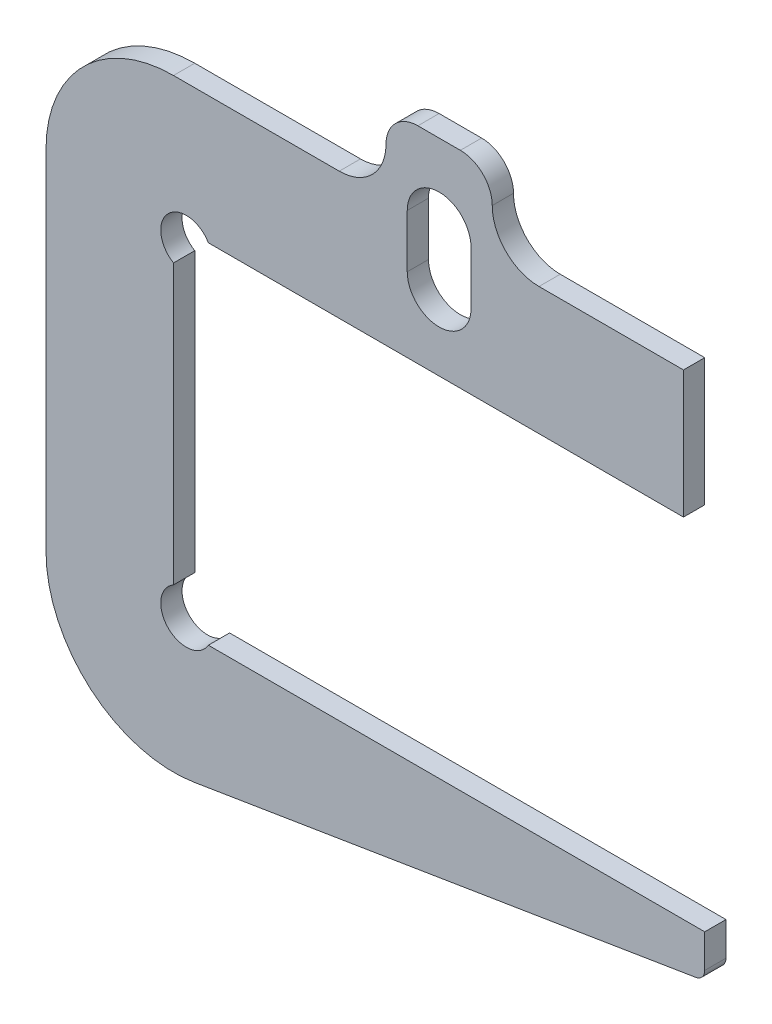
ISO-10303-21;
HEADER;
FILE_DESCRIPTION(('STEP AP214'),'2;1');
FILE_NAME('part.step','',(''),(''),'','','');
FILE_SCHEMA(('AUTOMOTIVE_DESIGN { 1 0 10303 214 1 1 1 1 }'));
ENDSEC;
DATA;
#1=APPLICATION_CONTEXT('core data for automotive mechanical design processes');
#2=APPLICATION_PROTOCOL_DEFINITION('international standard','automotive_design',2000,#1);
#3=PRODUCT_CONTEXT('',#1,'mechanical');
#4=PRODUCT('Part','Part','',(#3));
#5=PRODUCT_RELATED_PRODUCT_CATEGORY('part','',(#4));
#6=PRODUCT_DEFINITION_FORMATION('','',#4);
#7=PRODUCT_DEFINITION_CONTEXT('part definition',#1,'design');
#8=PRODUCT_DEFINITION('design','',#6,#7);
#9=PRODUCT_DEFINITION_SHAPE('','',#8);
#10=(LENGTH_UNIT() NAMED_UNIT(*) SI_UNIT(.MILLI.,.METRE.));
#11=(NAMED_UNIT(*) PLANE_ANGLE_UNIT() SI_UNIT($,.RADIAN.));
#12=(NAMED_UNIT(*) SI_UNIT($,.STERADIAN.) SOLID_ANGLE_UNIT());
#13=UNCERTAINTY_MEASURE_WITH_UNIT(LENGTH_MEASURE(1.E-05),#10,'distance_accuracy_value','');
#14=(GEOMETRIC_REPRESENTATION_CONTEXT(3) GLOBAL_UNCERTAINTY_ASSIGNED_CONTEXT((#13)) GLOBAL_UNIT_ASSIGNED_CONTEXT((#10,
#11,#12)) REPRESENTATION_CONTEXT('',''));
#15=CARTESIAN_POINT('',(0.,0.,0.));
#16=DIRECTION('',(0.,0.,1.));
#17=DIRECTION('',(1.,0.,0.));
#18=AXIS2_PLACEMENT_3D('',#15,#16,#17);
#19=CARTESIAN_POINT('',(-595.,-330.,25.));
#20=DIRECTION('',(0.,0.,1.));
#21=DIRECTION('',(1.,0.,0.));
#22=AXIS2_PLACEMENT_3D('',#19,#20,#21);
#23=PLANE('',#22);
#24=DIRECTION('',(0.,1.,0.));
#25=VECTOR('',#24,1.);
#26=CARTESIAN_POINT('',(575.,0.,25.));
#27=LINE('',#26,#25);
#28=CARTESIAN_POINT('',(575.,-300.,25.));
#29=VERTEX_POINT('',#28);
#30=CARTESIAN_POINT('',(575.,0.,25.));
#31=VERTEX_POINT('',#30);
#32=EDGE_CURVE('E225',#29,#31,#27,.T.);
#33=ORIENTED_EDGE('',*,*,#32,.T.);
#34=DIRECTION('',(-1.,0.,0.));
#35=VECTOR('',#34,1.);
#36=CARTESIAN_POINT('',(235.,0.,25.));
#37=LINE('',#36,#35);
#38=CARTESIAN_POINT('',(235.,0.,25.));
#39=VERTEX_POINT('',#38);
#40=EDGE_CURVE('E228',#31,#39,#37,.T.);
#41=ORIENTED_EDGE('',*,*,#40,.T.);
#42=CARTESIAN_POINT('',(235.,110.,25.));
#43=DIRECTION('',(0.,0.,-1.));
#44=DIRECTION('',(1.,0.,0.));
#45=AXIS2_PLACEMENT_3D('',#42,#43,#44);
#46=CIRCLE('',#45,110.);
#47=CARTESIAN_POINT('',(125.,110.,25.));
#48=VERTEX_POINT('',#47);
#49=EDGE_CURVE('E231',#39,#48,#46,.T.);
#50=ORIENTED_EDGE('',*,*,#49,.T.);
#51=CARTESIAN_POINT('',(50.0000000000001,110.,25.));
#52=DIRECTION('',(0.,0.,1.));
#53=DIRECTION('',(-1.,0.,0.));
#54=AXIS2_PLACEMENT_3D('',#51,#52,#53);
#55=CIRCLE('',#54,75.);
#56=CARTESIAN_POINT('',(50.,185.,25.));
#57=VERTEX_POINT('',#56);
#58=EDGE_CURVE('E233',#48,#57,#55,.T.);
#59=ORIENTED_EDGE('',*,*,#58,.T.);
#60=DIRECTION('',(-1.,0.,0.));
#61=VECTOR('',#60,1.);
#62=CARTESIAN_POINT('',(-50.,185.,25.));
#63=LINE('',#62,#61);
#64=CARTESIAN_POINT('',(-50.,185.,25.));
#65=VERTEX_POINT('',#64);
#66=EDGE_CURVE('E235',#57,#65,#63,.T.);
#67=ORIENTED_EDGE('',*,*,#66,.T.);
#68=CARTESIAN_POINT('',(-50.,110.,25.));
#69=DIRECTION('',(0.,0.,1.));
#70=DIRECTION('',(-1.,0.,0.));
#71=AXIS2_PLACEMENT_3D('',#68,#69,#70);
#72=CIRCLE('',#71,75.);
#73=CARTESIAN_POINT('',(-125.,110.,25.));
#74=VERTEX_POINT('',#73);
#75=EDGE_CURVE('E237',#65,#74,#72,.T.);
#76=ORIENTED_EDGE('',*,*,#75,.T.);
#77=CARTESIAN_POINT('',(-235.,110.,25.));
#78=DIRECTION('',(0.,0.,-1.));
#79=DIRECTION('',(1.,0.,0.));
#80=AXIS2_PLACEMENT_3D('',#77,#78,#79);
#81=CIRCLE('',#80,110.);
#82=CARTESIAN_POINT('',(-235.,0.,25.));
#83=VERTEX_POINT('',#82);
#84=EDGE_CURVE('E239',#74,#83,#81,.T.);
#85=ORIENTED_EDGE('',*,*,#84,.T.);
#86=DIRECTION('',(-1.,0.,0.));
#87=VECTOR('',#86,1.);
#88=CARTESIAN_POINT('',(-625.,0.,25.));
#89=LINE('',#88,#87);
#90=CARTESIAN_POINT('',(-625.,0.,25.));
#91=VERTEX_POINT('',#90);
#92=EDGE_CURVE('E241',#83,#91,#89,.T.);
#93=ORIENTED_EDGE('',*,*,#92,.T.);
#94=CARTESIAN_POINT('',(-625.,-300.,25.));
#95=DIRECTION('',(0.,0.,1.));
#96=DIRECTION('',(-1.,0.,0.));
#97=AXIS2_PLACEMENT_3D('',#94,#95,#96);
#98=CIRCLE('',#97,300.);
#99=CARTESIAN_POINT('',(-925.,-300.,25.));
#100=VERTEX_POINT('',#99);
#101=EDGE_CURVE('E243',#91,#100,#98,.T.);
#102=ORIENTED_EDGE('',*,*,#101,.T.);
#103=DIRECTION('',(0.,-1.,0.));
#104=VECTOR('',#103,1.);
#105=CARTESIAN_POINT('',(-925.,-1120.,25.));
#106=LINE('',#105,#104);
#107=CARTESIAN_POINT('',(-925.,-1120.,25.));
#108=VERTEX_POINT('',#107);
#109=EDGE_CURVE('E245',#100,#108,#106,.T.);
#110=ORIENTED_EDGE('',*,*,#109,.T.);
#111=CARTESIAN_POINT('',(-625.,-1120.,25.));
#112=DIRECTION('',(0.,0.,1.));
#113=DIRECTION('',(-1.,0.,0.));
#114=AXIS2_PLACEMENT_3D('',#111,#112,#113);
#115=CIRCLE('',#114,300.);
#116=CARTESIAN_POINT('',(-576.686732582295,-1416.08415727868,25.));
#117=VERTEX_POINT('',#116);
#118=EDGE_CURVE('E247',#108,#117,#115,.T.);
#119=ORIENTED_EDGE('',*,*,#118,.T.);
#120=DIRECTION('',(0.986947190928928,0.161044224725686,0.));
#121=VECTOR('',#120,1.);
#122=CARTESIAN_POINT('',(604.026105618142,-1223.4223964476,25.));
#123=LINE('',#122,#121);
#124=CARTESIAN_POINT('',(604.026105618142,-1223.4223964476,25.));
#125=VERTEX_POINT('',#124);
#126=EDGE_CURVE('E249',#117,#125,#123,.T.);
#127=ORIENTED_EDGE('',*,*,#126,.T.);
#128=CARTESIAN_POINT('',(600.,-1198.74871667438,25.));
#129=DIRECTION('',(0.,0.,1.));
#130=DIRECTION('',(-1.,0.,0.));
#131=AXIS2_PLACEMENT_3D('',#128,#129,#130);
#132=CIRCLE('',#131,25.0000000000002);
#133=CARTESIAN_POINT('',(625.,-1198.74871667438,25.));
#134=VERTEX_POINT('',#133);
#135=EDGE_CURVE('E251',#125,#134,#132,.T.);
#136=ORIENTED_EDGE('',*,*,#135,.T.);
#137=DIRECTION('',(0.,1.,0.));
#138=VECTOR('',#137,1.);
#139=CARTESIAN_POINT('',(625.,-1120.,25.));
#140=LINE('',#139,#138);
#141=CARTESIAN_POINT('',(625.,-1120.,25.));
#142=VERTEX_POINT('',#141);
#143=EDGE_CURVE('E253',#134,#142,#140,.T.);
#144=ORIENTED_EDGE('',*,*,#143,.T.);
#145=DIRECTION('',(-1.,0.,0.));
#146=VECTOR('',#145,1.);
#147=CARTESIAN_POINT('',(-543.038475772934,-1120.,25.));
#148=LINE('',#147,#146);
#149=CARTESIAN_POINT('',(-543.038475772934,-1120.,25.));
#150=VERTEX_POINT('',#149);
#151=EDGE_CURVE('E255',#142,#150,#148,.T.);
#152=ORIENTED_EDGE('',*,*,#151,.T.);
#153=CARTESIAN_POINT('',(-595.,-1090.,25.));
#154=DIRECTION('',(0.,0.,-1.));
#155=DIRECTION('',(1.,0.,0.));
#156=AXIS2_PLACEMENT_3D('',#153,#154,#155);
#157=CIRCLE('',#156,60.);
#158=CARTESIAN_POINT('',(-625.,-1038.03847577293,25.));
#159=VERTEX_POINT('',#158);
#160=EDGE_CURVE('E257',#150,#159,#157,.T.);
#161=ORIENTED_EDGE('',*,*,#160,.T.);
#162=DIRECTION('',(0.,1.,0.));
#163=VECTOR('',#162,1.);
#164=CARTESIAN_POINT('',(-625.,-381.961524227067,25.));
#165=LINE('',#164,#163);
#166=CARTESIAN_POINT('',(-625.,-381.961524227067,25.));
#167=VERTEX_POINT('',#166);
#168=EDGE_CURVE('E259',#159,#167,#165,.T.);
#169=ORIENTED_EDGE('',*,*,#168,.T.);
#170=CARTESIAN_POINT('',(-595.,-330.,25.));
#171=DIRECTION('',(0.,0.,-1.));
#172=DIRECTION('',(1.,0.,0.));
#173=AXIS2_PLACEMENT_3D('',#170,#171,#172);
#174=CIRCLE('',#173,60.);
#175=CARTESIAN_POINT('',(-543.038475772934,-300.,25.));
#176=VERTEX_POINT('',#175);
#177=EDGE_CURVE('E261',#167,#176,#174,.T.);
#178=ORIENTED_EDGE('',*,*,#177,.T.);
#179=DIRECTION('',(1.,0.,0.));
#180=VECTOR('',#179,1.);
#181=CARTESIAN_POINT('',(575.,-300.,25.));
#182=LINE('',#181,#180);
#183=EDGE_CURVE('E263',#176,#29,#182,.T.);
#184=ORIENTED_EDGE('',*,*,#183,.T.);
#185=EDGE_LOOP('',(#33,#41,#50,#59,#67,#76,#85,#93,#102,#110,#119,#127,#136,#144,#152,#161,#169,
#178,#184));
#186=FACE_BOUND('',#185,.T.);
#187=DIRECTION('',(0.,-1.,0.));
#188=VECTOR('',#187,1.);
#189=CARTESIAN_POINT('',(-75.,0.,25.));
#190=LINE('',#189,#188);
#191=CARTESIAN_POINT('',(-75.,0.,25.));
#192=VERTEX_POINT('',#191);
#193=CARTESIAN_POINT('',(-75.,-125.,25.));
#194=VERTEX_POINT('',#193);
#195=EDGE_CURVE('E197',#192,#194,#190,.T.);
#196=ORIENTED_EDGE('',*,*,#195,.F.);
#197=CARTESIAN_POINT('',(0.,0.,25.));
#198=DIRECTION('',(0.,0.,1.));
#199=DIRECTION('',(1.,0.,0.));
#200=AXIS2_PLACEMENT_3D('',#197,#198,#199);
#201=CIRCLE('',#200,75.);
#202=CARTESIAN_POINT('',(75.,0.,25.));
#203=VERTEX_POINT('',#202);
#204=EDGE_CURVE('E189',#203,#192,#201,.T.);
#205=ORIENTED_EDGE('',*,*,#204,.F.);
#206=DIRECTION('',(0.,1.,0.));
#207=VECTOR('',#206,1.);
#208=CARTESIAN_POINT('',(75.,0.,25.));
#209=LINE('',#208,#207);
#210=CARTESIAN_POINT('',(74.9999999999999,-125.,25.));
#211=VERTEX_POINT('',#210);
#212=EDGE_CURVE('E211',#211,#203,#209,.T.);
#213=ORIENTED_EDGE('',*,*,#212,.F.);
#214=CARTESIAN_POINT('',(0.,-125.,25.));
#215=DIRECTION('',(0.,0.,1.));
#216=DIRECTION('',(1.,0.,0.));
#217=AXIS2_PLACEMENT_3D('',#214,#215,#216);
#218=CIRCLE('',#217,75.);
#219=EDGE_CURVE('E209',#194,#211,#218,.T.);
#220=ORIENTED_EDGE('',*,*,#219,.F.);
#221=EDGE_LOOP('',(#196,#205,#213,#220));
#222=FACE_BOUND('',#221,.T.);
#223=ADVANCED_FACE('F34',(#186,#222),#23,.T.);
#224=CARTESIAN_POINT('',(-595.,-330.,-25.));
#225=DIRECTION('',(0.,0.,1.));
#226=DIRECTION('',(1.,0.,0.));
#227=AXIS2_PLACEMENT_3D('',#224,#225,#226);
#228=PLANE('',#227);
#229=DIRECTION('',(0.,1.,0.));
#230=VECTOR('',#229,1.);
#231=CARTESIAN_POINT('',(575.,0.,-25.));
#232=LINE('',#231,#230);
#233=CARTESIAN_POINT('',(575.,-300.,-25.));
#234=VERTEX_POINT('',#233);
#235=CARTESIAN_POINT('',(575.,0.,-25.));
#236=VERTEX_POINT('',#235);
#237=EDGE_CURVE('E205',#234,#236,#232,.T.);
#238=ORIENTED_EDGE('',*,*,#237,.F.);
#239=DIRECTION('',(1.,0.,0.));
#240=VECTOR('',#239,1.);
#241=CARTESIAN_POINT('',(575.,-300.,-25.));
#242=LINE('',#241,#240);
#243=CARTESIAN_POINT('',(-543.038475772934,-300.,-25.));
#244=VERTEX_POINT('',#243);
#245=EDGE_CURVE('E229',#244,#234,#242,.T.);
#246=ORIENTED_EDGE('',*,*,#245,.F.);
#247=CARTESIAN_POINT('',(-595.,-330.,-25.));
#248=DIRECTION('',(0.,0.,-1.));
#249=DIRECTION('',(1.,0.,0.));
#250=AXIS2_PLACEMENT_3D('',#247,#248,#249);
#251=CIRCLE('',#250,60.);
#252=CARTESIAN_POINT('',(-625.,-381.961524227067,-25.));
#253=VERTEX_POINT('',#252);
#254=EDGE_CURVE('E300',#253,#244,#251,.T.);
#255=ORIENTED_EDGE('',*,*,#254,.F.);
#256=DIRECTION('',(0.,1.,0.));
#257=VECTOR('',#256,1.);
#258=CARTESIAN_POINT('',(-625.,-381.961524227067,-25.));
#259=LINE('',#258,#257);
#260=CARTESIAN_POINT('',(-625.,-1038.03847577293,-25.));
#261=VERTEX_POINT('',#260);
#262=EDGE_CURVE('E298',#261,#253,#259,.T.);
#263=ORIENTED_EDGE('',*,*,#262,.F.);
#264=CARTESIAN_POINT('',(-595.,-1090.,-25.));
#265=DIRECTION('',(0.,0.,-1.));
#266=DIRECTION('',(1.,0.,0.));
#267=AXIS2_PLACEMENT_3D('',#264,#265,#266);
#268=CIRCLE('',#267,60.);
#269=CARTESIAN_POINT('',(-543.038475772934,-1120.,-25.));
#270=VERTEX_POINT('',#269);
#271=EDGE_CURVE('E296',#270,#261,#268,.T.);
#272=ORIENTED_EDGE('',*,*,#271,.F.);
#273=DIRECTION('',(-1.,0.,0.));
#274=VECTOR('',#273,1.);
#275=CARTESIAN_POINT('',(-543.038475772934,-1120.,-25.));
#276=LINE('',#275,#274);
#277=CARTESIAN_POINT('',(625.,-1120.,-25.));
#278=VERTEX_POINT('',#277);
#279=EDGE_CURVE('E294',#278,#270,#276,.T.);
#280=ORIENTED_EDGE('',*,*,#279,.F.);
#281=DIRECTION('',(0.,1.,0.));
#282=VECTOR('',#281,1.);
#283=CARTESIAN_POINT('',(625.,-1120.,-25.));
#284=LINE('',#283,#282);
#285=CARTESIAN_POINT('',(625.,-1198.74871667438,-25.));
#286=VERTEX_POINT('',#285);
#287=EDGE_CURVE('E292',#286,#278,#284,.T.);
#288=ORIENTED_EDGE('',*,*,#287,.F.);
#289=CARTESIAN_POINT('',(600.,-1198.74871667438,-25.));
#290=DIRECTION('',(0.,0.,1.));
#291=DIRECTION('',(-1.,0.,0.));
#292=AXIS2_PLACEMENT_3D('',#289,#290,#291);
#293=CIRCLE('',#292,25.0000000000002);
#294=CARTESIAN_POINT('',(604.026105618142,-1223.4223964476,-25.));
#295=VERTEX_POINT('',#294);
#296=EDGE_CURVE('E290',#295,#286,#293,.T.);
#297=ORIENTED_EDGE('',*,*,#296,.F.);
#298=DIRECTION('',(0.986947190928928,0.161044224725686,0.));
#299=VECTOR('',#298,1.);
#300=CARTESIAN_POINT('',(604.026105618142,-1223.4223964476,-25.));
#301=LINE('',#300,#299);
#302=CARTESIAN_POINT('',(-576.686732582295,-1416.08415727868,-25.));
#303=VERTEX_POINT('',#302);
#304=EDGE_CURVE('E288',#303,#295,#301,.T.);
#305=ORIENTED_EDGE('',*,*,#304,.F.);
#306=CARTESIAN_POINT('',(-625.,-1120.,-25.));
#307=DIRECTION('',(0.,0.,1.));
#308=DIRECTION('',(-1.,0.,0.));
#309=AXIS2_PLACEMENT_3D('',#306,#307,#308);
#310=CIRCLE('',#309,300.);
#311=CARTESIAN_POINT('',(-925.,-1120.,-25.));
#312=VERTEX_POINT('',#311);
#313=EDGE_CURVE('E286',#312,#303,#310,.T.);
#314=ORIENTED_EDGE('',*,*,#313,.F.);
#315=DIRECTION('',(0.,-1.,0.));
#316=VECTOR('',#315,1.);
#317=CARTESIAN_POINT('',(-925.,-1120.,-25.));
#318=LINE('',#317,#316);
#319=CARTESIAN_POINT('',(-925.,-300.,-25.));
#320=VERTEX_POINT('',#319);
#321=EDGE_CURVE('E284',#320,#312,#318,.T.);
#322=ORIENTED_EDGE('',*,*,#321,.F.);
#323=CARTESIAN_POINT('',(-625.,-300.,-25.));
#324=DIRECTION('',(0.,0.,1.));
#325=DIRECTION('',(-1.,0.,0.));
#326=AXIS2_PLACEMENT_3D('',#323,#324,#325);
#327=CIRCLE('',#326,300.);
#328=CARTESIAN_POINT('',(-625.,0.,-25.));
#329=VERTEX_POINT('',#328);
#330=EDGE_CURVE('E282',#329,#320,#327,.T.);
#331=ORIENTED_EDGE('',*,*,#330,.F.);
#332=DIRECTION('',(-1.,0.,0.));
#333=VECTOR('',#332,1.);
#334=CARTESIAN_POINT('',(-625.,0.,-25.));
#335=LINE('',#334,#333);
#336=CARTESIAN_POINT('',(-235.,0.,-25.));
#337=VERTEX_POINT('',#336);
#338=EDGE_CURVE('E280',#337,#329,#335,.T.);
#339=ORIENTED_EDGE('',*,*,#338,.F.);
#340=CARTESIAN_POINT('',(-235.,110.,-25.));
#341=DIRECTION('',(0.,0.,-1.));
#342=DIRECTION('',(1.,0.,0.));
#343=AXIS2_PLACEMENT_3D('',#340,#341,#342);
#344=CIRCLE('',#343,110.);
#345=CARTESIAN_POINT('',(-125.,110.,-25.));
#346=VERTEX_POINT('',#345);
#347=EDGE_CURVE('E278',#346,#337,#344,.T.);
#348=ORIENTED_EDGE('',*,*,#347,.F.);
#349=CARTESIAN_POINT('',(-50.,110.,-25.));
#350=DIRECTION('',(0.,0.,1.));
#351=DIRECTION('',(-1.,0.,0.));
#352=AXIS2_PLACEMENT_3D('',#349,#350,#351);
#353=CIRCLE('',#352,75.);
#354=CARTESIAN_POINT('',(-50.,185.,-25.));
#355=VERTEX_POINT('',#354);
#356=EDGE_CURVE('E276',#355,#346,#353,.T.);
#357=ORIENTED_EDGE('',*,*,#356,.F.);
#358=DIRECTION('',(-1.,0.,0.));
#359=VECTOR('',#358,1.);
#360=CARTESIAN_POINT('',(-50.,185.,-25.));
#361=LINE('',#360,#359);
#362=CARTESIAN_POINT('',(50.,185.,-25.));
#363=VERTEX_POINT('',#362);
#364=EDGE_CURVE('E274',#363,#355,#361,.T.);
#365=ORIENTED_EDGE('',*,*,#364,.F.);
#366=CARTESIAN_POINT('',(50.0000000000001,110.,-25.));
#367=DIRECTION('',(0.,0.,1.));
#368=DIRECTION('',(-1.,0.,0.));
#369=AXIS2_PLACEMENT_3D('',#366,#367,#368);
#370=CIRCLE('',#369,75.);
#371=CARTESIAN_POINT('',(125.,110.,-25.));
#372=VERTEX_POINT('',#371);
#373=EDGE_CURVE('E272',#372,#363,#370,.T.);
#374=ORIENTED_EDGE('',*,*,#373,.F.);
#375=CARTESIAN_POINT('',(235.,110.,-25.));
#376=DIRECTION('',(0.,0.,-1.));
#377=DIRECTION('',(1.,0.,0.));
#378=AXIS2_PLACEMENT_3D('',#375,#376,#377);
#379=CIRCLE('',#378,110.);
#380=CARTESIAN_POINT('',(235.,0.,-25.));
#381=VERTEX_POINT('',#380);
#382=EDGE_CURVE('E270',#381,#372,#379,.T.);
#383=ORIENTED_EDGE('',*,*,#382,.F.);
#384=DIRECTION('',(-1.,0.,0.));
#385=VECTOR('',#384,1.);
#386=CARTESIAN_POINT('',(235.,0.,-25.));
#387=LINE('',#386,#385);
#388=EDGE_CURVE('E268',#236,#381,#387,.T.);
#389=ORIENTED_EDGE('',*,*,#388,.F.);
#390=EDGE_LOOP('',(#238,#246,#255,#263,#272,#280,#288,#297,#305,#314,#322,#331,#339,#348,#357,
#365,#374,#383,#389));
#391=FACE_BOUND('',#390,.T.);
#392=CARTESIAN_POINT('',(0.,0.,-25.));
#393=DIRECTION('',(0.,0.,1.));
#394=DIRECTION('',(1.,0.,0.));
#395=AXIS2_PLACEMENT_3D('',#392,#393,#394);
#396=CIRCLE('',#395,75.);
#397=CARTESIAN_POINT('',(74.9999999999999,0.,-25.));
#398=VERTEX_POINT('',#397);
#399=CARTESIAN_POINT('',(-75.,0.,-25.));
#400=VERTEX_POINT('',#399);
#401=EDGE_CURVE('E57',#398,#400,#396,.T.);
#402=ORIENTED_EDGE('',*,*,#401,.T.);
#403=DIRECTION('',(0.,-1.,0.));
#404=VECTOR('',#403,1.);
#405=CARTESIAN_POINT('',(-75.,0.,-25.));
#406=LINE('',#405,#404);
#407=CARTESIAN_POINT('',(-75.,-125.,-25.));
#408=VERTEX_POINT('',#407);
#409=EDGE_CURVE('E204',#400,#408,#406,.T.);
#410=ORIENTED_EDGE('',*,*,#409,.T.);
#411=CARTESIAN_POINT('',(0.,-125.,-25.));
#412=DIRECTION('',(0.,0.,1.));
#413=DIRECTION('',(1.,0.,0.));
#414=AXIS2_PLACEMENT_3D('',#411,#412,#413);
#415=CIRCLE('',#414,75.);
#416=CARTESIAN_POINT('',(75.,-125.,-25.));
#417=VERTEX_POINT('',#416);
#418=EDGE_CURVE('E217',#408,#417,#415,.T.);
#419=ORIENTED_EDGE('',*,*,#418,.T.);
#420=DIRECTION('',(0.,1.,0.));
#421=VECTOR('',#420,1.);
#422=CARTESIAN_POINT('',(75.,0.,-25.));
#423=LINE('',#422,#421);
#424=EDGE_CURVE('E198',#417,#398,#423,.T.);
#425=ORIENTED_EDGE('',*,*,#424,.T.);
#426=EDGE_LOOP('',(#402,#410,#419,#425));
#427=FACE_BOUND('',#426,.T.);
#428=ADVANCED_FACE('F363',(#391,#427),#228,.F.);
#429=CARTESIAN_POINT('',(575.,0.,25.));
#430=DIRECTION('',(-1.,0.,0.));
#431=DIRECTION('',(0.,-1.,0.));
#432=AXIS2_PLACEMENT_3D('',#429,#430,#431);
#433=PLANE('',#432);
#434=ORIENTED_EDGE('',*,*,#237,.T.);
#435=DIRECTION('',(0.,0.,-1.));
#436=VECTOR('',#435,1.);
#437=CARTESIAN_POINT('',(575.,0.,25.));
#438=LINE('',#437,#436);
#439=EDGE_CURVE('E11',#31,#236,#438,.T.);
#440=ORIENTED_EDGE('',*,*,#439,.F.);
#441=ORIENTED_EDGE('',*,*,#32,.F.);
#442=DIRECTION('',(0.,0.,-1.));
#443=VECTOR('',#442,1.);
#444=CARTESIAN_POINT('',(575.,-300.,25.));
#445=LINE('',#444,#443);
#446=EDGE_CURVE('E265',#29,#234,#445,.T.);
#447=ORIENTED_EDGE('',*,*,#446,.T.);
#448=EDGE_LOOP('',(#434,#440,#441,#447));
#449=FACE_BOUND('',#448,.T.);
#450=ADVANCED_FACE('F36',(#449),#433,.F.);
#451=CARTESIAN_POINT('',(235.,0.,25.));
#452=DIRECTION('',(0.,-1.,0.));
#453=DIRECTION('',(0.,0.,-1.));
#454=AXIS2_PLACEMENT_3D('',#451,#452,#453);
#455=PLANE('',#454);
#456=ORIENTED_EDGE('',*,*,#388,.T.);
#457=DIRECTION('',(0.,0.,-1.));
#458=VECTOR('',#457,1.);
#459=CARTESIAN_POINT('',(235.,0.,25.));
#460=LINE('',#459,#458);
#461=EDGE_CURVE('E42',#39,#381,#460,.T.);
#462=ORIENTED_EDGE('',*,*,#461,.F.);
#463=ORIENTED_EDGE('',*,*,#40,.F.);
#464=ORIENTED_EDGE('',*,*,#439,.T.);
#465=EDGE_LOOP('',(#456,#462,#463,#464));
#466=FACE_BOUND('',#465,.T.);
#467=ADVANCED_FACE('F380',(#466),#455,.F.);
#468=CARTESIAN_POINT('',(235.,110.,25.));
#469=DIRECTION('',(0.,0.,-1.));
#470=DIRECTION('',(-1.,0.,0.));
#471=AXIS2_PLACEMENT_3D('',#468,#469,#470);
#472=CYLINDRICAL_SURFACE('',#471,110.);
#473=ORIENTED_EDGE('',*,*,#382,.T.);
#474=DIRECTION('',(0.,0.,-1.));
#475=VECTOR('',#474,1.);
#476=CARTESIAN_POINT('',(125.,110.,25.));
#477=LINE('',#476,#475);
#478=EDGE_CURVE('E350',#48,#372,#477,.T.);
#479=ORIENTED_EDGE('',*,*,#478,.F.);
#480=ORIENTED_EDGE('',*,*,#49,.F.);
#481=ORIENTED_EDGE('',*,*,#461,.T.);
#482=EDGE_LOOP('',(#473,#479,#480,#481));
#483=FACE_BOUND('',#482,.T.);
#484=ADVANCED_FACE('F357',(#483),#472,.F.);
#485=CARTESIAN_POINT('',(50.0000000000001,110.,25.));
#486=DIRECTION('',(0.,0.,-1.));
#487=DIRECTION('',(-1.,0.,0.));
#488=AXIS2_PLACEMENT_3D('',#485,#486,#487);
#489=CYLINDRICAL_SURFACE('',#488,75.);
#490=ORIENTED_EDGE('',*,*,#373,.T.);
#491=DIRECTION('',(0.,0.,-1.));
#492=VECTOR('',#491,1.);
#493=CARTESIAN_POINT('',(50.,185.,25.));
#494=LINE('',#493,#492);
#495=EDGE_CURVE('E347',#57,#363,#494,.T.);
#496=ORIENTED_EDGE('',*,*,#495,.F.);
#497=ORIENTED_EDGE('',*,*,#58,.F.);
#498=ORIENTED_EDGE('',*,*,#478,.T.);
#499=EDGE_LOOP('',(#490,#496,#497,#498));
#500=FACE_BOUND('',#499,.T.);
#501=ADVANCED_FACE('F369',(#500),#489,.T.);
#502=CARTESIAN_POINT('',(-50.,185.,25.));
#503=DIRECTION('',(0.,-1.,0.));
#504=DIRECTION('',(0.,0.,-1.));
#505=AXIS2_PLACEMENT_3D('',#502,#503,#504);
#506=PLANE('',#505);
#507=ORIENTED_EDGE('',*,*,#364,.T.);
#508=DIRECTION('',(0.,0.,-1.));
#509=VECTOR('',#508,1.);
#510=CARTESIAN_POINT('',(-50.,185.,25.));
#511=LINE('',#510,#509);
#512=EDGE_CURVE('E344',#65,#355,#511,.T.);
#513=ORIENTED_EDGE('',*,*,#512,.F.);
#514=ORIENTED_EDGE('',*,*,#66,.F.);
#515=ORIENTED_EDGE('',*,*,#495,.T.);
#516=EDGE_LOOP('',(#507,#513,#514,#515));
#517=FACE_BOUND('',#516,.T.);
#518=ADVANCED_FACE('F373',(#517),#506,.F.);
#519=CARTESIAN_POINT('',(-50.,110.,25.));
#520=DIRECTION('',(0.,0.,-1.));
#521=DIRECTION('',(-1.,0.,0.));
#522=AXIS2_PLACEMENT_3D('',#519,#520,#521);
#523=CYLINDRICAL_SURFACE('',#522,75.);
#524=ORIENTED_EDGE('',*,*,#356,.T.);
#525=DIRECTION('',(0.,0.,-1.));
#526=VECTOR('',#525,1.);
#527=CARTESIAN_POINT('',(-125.,110.,25.));
#528=LINE('',#527,#526);
#529=EDGE_CURVE('E341',#74,#346,#528,.T.);
#530=ORIENTED_EDGE('',*,*,#529,.F.);
#531=ORIENTED_EDGE('',*,*,#75,.F.);
#532=ORIENTED_EDGE('',*,*,#512,.T.);
#533=EDGE_LOOP('',(#524,#530,#531,#532));
#534=FACE_BOUND('',#533,.T.);
#535=ADVANCED_FACE('F448',(#534),#523,.T.);
#536=CARTESIAN_POINT('',(-235.,110.,25.));
#537=DIRECTION('',(0.,0.,-1.));
#538=DIRECTION('',(-1.,0.,0.));
#539=AXIS2_PLACEMENT_3D('',#536,#537,#538);
#540=CYLINDRICAL_SURFACE('',#539,110.);
#541=ORIENTED_EDGE('',*,*,#347,.T.);
#542=DIRECTION('',(0.,0.,-1.));
#543=VECTOR('',#542,1.);
#544=CARTESIAN_POINT('',(-235.,0.,25.));
#545=LINE('',#544,#543);
#546=EDGE_CURVE('E338',#83,#337,#545,.T.);
#547=ORIENTED_EDGE('',*,*,#546,.F.);
#548=ORIENTED_EDGE('',*,*,#84,.F.);
#549=ORIENTED_EDGE('',*,*,#529,.T.);
#550=EDGE_LOOP('',(#541,#547,#548,#549));
#551=FACE_BOUND('',#550,.T.);
#552=ADVANCED_FACE('F445',(#551),#540,.F.);
#553=CARTESIAN_POINT('',(-625.,0.,25.));
#554=DIRECTION('',(0.,-1.,0.));
#555=DIRECTION('',(0.,0.,-1.));
#556=AXIS2_PLACEMENT_3D('',#553,#554,#555);
#557=PLANE('',#556);
#558=ORIENTED_EDGE('',*,*,#338,.T.);
#559=DIRECTION('',(0.,0.,-1.));
#560=VECTOR('',#559,1.);
#561=CARTESIAN_POINT('',(-625.,0.,25.));
#562=LINE('',#561,#560);
#563=EDGE_CURVE('E335',#91,#329,#562,.T.);
#564=ORIENTED_EDGE('',*,*,#563,.F.);
#565=ORIENTED_EDGE('',*,*,#92,.F.);
#566=ORIENTED_EDGE('',*,*,#546,.T.);
#567=EDGE_LOOP('',(#558,#564,#565,#566));
#568=FACE_BOUND('',#567,.T.);
#569=ADVANCED_FACE('F441',(#568),#557,.F.);
#570=CARTESIAN_POINT('',(-625.,-300.,25.));
#571=DIRECTION('',(0.,0.,-1.));
#572=DIRECTION('',(-1.,0.,0.));
#573=AXIS2_PLACEMENT_3D('',#570,#571,#572);
#574=CYLINDRICAL_SURFACE('',#573,300.);
#575=ORIENTED_EDGE('',*,*,#330,.T.);
#576=DIRECTION('',(0.,0.,-1.));
#577=VECTOR('',#576,1.);
#578=CARTESIAN_POINT('',(-925.,-300.,25.));
#579=LINE('',#578,#577);
#580=EDGE_CURVE('E332',#100,#320,#579,.T.);
#581=ORIENTED_EDGE('',*,*,#580,.F.);
#582=ORIENTED_EDGE('',*,*,#101,.F.);
#583=ORIENTED_EDGE('',*,*,#563,.T.);
#584=EDGE_LOOP('',(#575,#581,#582,#583));
#585=FACE_BOUND('',#584,.T.);
#586=ADVANCED_FACE('F437',(#585),#574,.T.);
#587=CARTESIAN_POINT('',(-925.,-1120.,25.));
#588=DIRECTION('',(1.,0.,0.));
#589=DIRECTION('',(0.,0.,-1.));
#590=AXIS2_PLACEMENT_3D('',#587,#588,#589);
#591=PLANE('',#590);
#592=ORIENTED_EDGE('',*,*,#321,.T.);
#593=DIRECTION('',(0.,0.,-1.));
#594=VECTOR('',#593,1.);
#595=CARTESIAN_POINT('',(-925.,-1120.,25.));
#596=LINE('',#595,#594);
#597=EDGE_CURVE('E329',#108,#312,#596,.T.);
#598=ORIENTED_EDGE('',*,*,#597,.F.);
#599=ORIENTED_EDGE('',*,*,#109,.F.);
#600=ORIENTED_EDGE('',*,*,#580,.T.);
#601=EDGE_LOOP('',(#592,#598,#599,#600));
#602=FACE_BOUND('',#601,.T.);
#603=ADVANCED_FACE('F432',(#602),#591,.F.);
#604=CARTESIAN_POINT('',(-625.,-1120.,25.));
#605=DIRECTION('',(0.,0.,-1.));
#606=DIRECTION('',(-1.,0.,0.));
#607=AXIS2_PLACEMENT_3D('',#604,#605,#606);
#608=CYLINDRICAL_SURFACE('',#607,300.);
#609=ORIENTED_EDGE('',*,*,#313,.T.);
#610=DIRECTION('',(0.,0.,-1.));
#611=VECTOR('',#610,1.);
#612=CARTESIAN_POINT('',(-576.686732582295,-1416.08415727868,25.));
#613=LINE('',#612,#611);
#614=EDGE_CURVE('E326',#117,#303,#613,.T.);
#615=ORIENTED_EDGE('',*,*,#614,.F.);
#616=ORIENTED_EDGE('',*,*,#118,.F.);
#617=ORIENTED_EDGE('',*,*,#597,.T.);
#618=EDGE_LOOP('',(#609,#615,#616,#617));
#619=FACE_BOUND('',#618,.T.);
#620=ADVANCED_FACE('F426',(#619),#608,.T.);
#621=CARTESIAN_POINT('',(604.026105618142,-1223.4223964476,25.));
#622=DIRECTION('',(-0.161044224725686,0.986947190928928,0.));
#623=DIRECTION('',(-0.986947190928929,-0.161044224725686,0.));
#624=AXIS2_PLACEMENT_3D('',#621,#622,#623);
#625=PLANE('',#624);
#626=ORIENTED_EDGE('',*,*,#304,.T.);
#627=DIRECTION('',(0.,0.,-1.));
#628=VECTOR('',#627,1.);
#629=CARTESIAN_POINT('',(604.026105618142,-1223.4223964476,25.));
#630=LINE('',#629,#628);
#631=EDGE_CURVE('E323',#125,#295,#630,.T.);
#632=ORIENTED_EDGE('',*,*,#631,.F.);
#633=ORIENTED_EDGE('',*,*,#126,.F.);
#634=ORIENTED_EDGE('',*,*,#614,.T.);
#635=EDGE_LOOP('',(#626,#632,#633,#634));
#636=FACE_BOUND('',#635,.T.);
#637=ADVANCED_FACE('F422',(#636),#625,.F.);
#638=CARTESIAN_POINT('',(600.,-1198.74871667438,25.));
#639=DIRECTION('',(0.,0.,-1.));
#640=DIRECTION('',(-1.,0.,0.));
#641=AXIS2_PLACEMENT_3D('',#638,#639,#640);
#642=CYLINDRICAL_SURFACE('',#641,25.0000000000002);
#643=ORIENTED_EDGE('',*,*,#296,.T.);
#644=DIRECTION('',(0.,0.,-1.));
#645=VECTOR('',#644,1.);
#646=CARTESIAN_POINT('',(625.,-1198.74871667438,25.));
#647=LINE('',#646,#645);
#648=EDGE_CURVE('E320',#134,#286,#647,.T.);
#649=ORIENTED_EDGE('',*,*,#648,.F.);
#650=ORIENTED_EDGE('',*,*,#135,.F.);
#651=ORIENTED_EDGE('',*,*,#631,.T.);
#652=EDGE_LOOP('',(#643,#649,#650,#651));
#653=FACE_BOUND('',#652,.T.);
#654=ADVANCED_FACE('F417',(#653),#642,.T.);
#655=CARTESIAN_POINT('',(625.,-1120.,25.));
#656=DIRECTION('',(-1.,0.,0.));
#657=DIRECTION('',(0.,-1.,0.));
#658=AXIS2_PLACEMENT_3D('',#655,#656,#657);
#659=PLANE('',#658);
#660=ORIENTED_EDGE('',*,*,#287,.T.);
#661=DIRECTION('',(0.,0.,-1.));
#662=VECTOR('',#661,1.);
#663=CARTESIAN_POINT('',(625.,-1120.,25.));
#664=LINE('',#663,#662);
#665=EDGE_CURVE('E317',#142,#278,#664,.T.);
#666=ORIENTED_EDGE('',*,*,#665,.F.);
#667=ORIENTED_EDGE('',*,*,#143,.F.);
#668=ORIENTED_EDGE('',*,*,#648,.T.);
#669=EDGE_LOOP('',(#660,#666,#667,#668));
#670=FACE_BOUND('',#669,.T.);
#671=ADVANCED_FACE('F411',(#670),#659,.F.);
#672=CARTESIAN_POINT('',(-543.038475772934,-1120.,25.));
#673=DIRECTION('',(0.,-1.,0.));
#674=DIRECTION('',(1.,0.,0.));
#675=AXIS2_PLACEMENT_3D('',#672,#673,#674);
#676=PLANE('',#675);
#677=ORIENTED_EDGE('',*,*,#279,.T.);
#678=DIRECTION('',(0.,0.,-1.));
#679=VECTOR('',#678,1.);
#680=CARTESIAN_POINT('',(-543.038475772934,-1120.,25.));
#681=LINE('',#680,#679);
#682=EDGE_CURVE('E314',#150,#270,#681,.T.);
#683=ORIENTED_EDGE('',*,*,#682,.F.);
#684=ORIENTED_EDGE('',*,*,#151,.F.);
#685=ORIENTED_EDGE('',*,*,#665,.T.);
#686=EDGE_LOOP('',(#677,#683,#684,#685));
#687=FACE_BOUND('',#686,.T.);
#688=ADVANCED_FACE('F407',(#687),#676,.F.);
#689=CARTESIAN_POINT('',(-595.,-1090.,25.));
#690=DIRECTION('',(0.,0.,-1.));
#691=DIRECTION('',(-1.,0.,0.));
#692=AXIS2_PLACEMENT_3D('',#689,#690,#691);
#693=CYLINDRICAL_SURFACE('',#692,60.);
#694=ORIENTED_EDGE('',*,*,#271,.T.);
#695=DIRECTION('',(0.,0.,-1.));
#696=VECTOR('',#695,1.);
#697=CARTESIAN_POINT('',(-625.,-1038.03847577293,25.));
#698=LINE('',#697,#696);
#699=EDGE_CURVE('E311',#159,#261,#698,.T.);
#700=ORIENTED_EDGE('',*,*,#699,.F.);
#701=ORIENTED_EDGE('',*,*,#160,.F.);
#702=ORIENTED_EDGE('',*,*,#682,.T.);
#703=EDGE_LOOP('',(#694,#700,#701,#702));
#704=FACE_BOUND('',#703,.T.);
#705=ADVANCED_FACE('F402',(#704),#693,.F.);
#706=CARTESIAN_POINT('',(-625.,-381.961524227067,25.));
#707=DIRECTION('',(-1.,0.,0.));
#708=DIRECTION('',(0.,0.,1.));
#709=AXIS2_PLACEMENT_3D('',#706,#707,#708);
#710=PLANE('',#709);
#711=ORIENTED_EDGE('',*,*,#262,.T.);
#712=DIRECTION('',(0.,0.,-1.));
#713=VECTOR('',#712,1.);
#714=CARTESIAN_POINT('',(-625.,-381.961524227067,25.));
#715=LINE('',#714,#713);
#716=EDGE_CURVE('E308',#167,#253,#715,.T.);
#717=ORIENTED_EDGE('',*,*,#716,.F.);
#718=ORIENTED_EDGE('',*,*,#168,.F.);
#719=ORIENTED_EDGE('',*,*,#699,.T.);
#720=EDGE_LOOP('',(#711,#717,#718,#719));
#721=FACE_BOUND('',#720,.T.);
#722=ADVANCED_FACE('F396',(#721),#710,.F.);
#723=CARTESIAN_POINT('',(-595.,-330.,25.));
#724=DIRECTION('',(0.,0.,-1.));
#725=DIRECTION('',(-1.,0.,0.));
#726=AXIS2_PLACEMENT_3D('',#723,#724,#725);
#727=CYLINDRICAL_SURFACE('',#726,60.);
#728=ORIENTED_EDGE('',*,*,#254,.T.);
#729=DIRECTION('',(0.,0.,-1.));
#730=VECTOR('',#729,1.);
#731=CARTESIAN_POINT('',(-543.038475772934,-300.,25.));
#732=LINE('',#731,#730);
#733=EDGE_CURVE('E305',#176,#244,#732,.T.);
#734=ORIENTED_EDGE('',*,*,#733,.F.);
#735=ORIENTED_EDGE('',*,*,#177,.F.);
#736=ORIENTED_EDGE('',*,*,#716,.T.);
#737=EDGE_LOOP('',(#728,#734,#735,#736));
#738=FACE_BOUND('',#737,.T.);
#739=ADVANCED_FACE('F392',(#738),#727,.F.);
#740=CARTESIAN_POINT('',(575.,-300.,25.));
#741=DIRECTION('',(0.,1.,0.));
#742=DIRECTION('',(-1.,0.,0.));
#743=AXIS2_PLACEMENT_3D('',#740,#741,#742);
#744=PLANE('',#743);
#745=ORIENTED_EDGE('',*,*,#245,.T.);
#746=ORIENTED_EDGE('',*,*,#446,.F.);
#747=ORIENTED_EDGE('',*,*,#183,.F.);
#748=ORIENTED_EDGE('',*,*,#733,.T.);
#749=EDGE_LOOP('',(#745,#746,#747,#748));
#750=FACE_BOUND('',#749,.T.);
#751=ADVANCED_FACE('F387',(#750),#744,.F.);
#752=CARTESIAN_POINT('',(0.,0.,25.));
#753=DIRECTION('',(0.,0.,-1.));
#754=DIRECTION('',(-1.,0.,0.));
#755=AXIS2_PLACEMENT_3D('',#752,#753,#754);
#756=CYLINDRICAL_SURFACE('',#755,75.);
#757=ORIENTED_EDGE('',*,*,#401,.F.);
#758=DIRECTION('',(0.,0.,-1.));
#759=VECTOR('',#758,1.);
#760=CARTESIAN_POINT('',(75.,0.,25.));
#761=LINE('',#760,#759);
#762=EDGE_CURVE('E193',#203,#398,#761,.T.);
#763=ORIENTED_EDGE('',*,*,#762,.F.);
#764=ORIENTED_EDGE('',*,*,#204,.T.);
#765=DIRECTION('',(0.,0.,-1.));
#766=VECTOR('',#765,1.);
#767=CARTESIAN_POINT('',(-75.,0.,25.));
#768=LINE('',#767,#766);
#769=EDGE_CURVE('E192',#192,#400,#768,.T.);
#770=ORIENTED_EDGE('',*,*,#769,.T.);
#771=EDGE_LOOP('',(#757,#763,#764,#770));
#772=FACE_BOUND('',#771,.T.);
#773=ADVANCED_FACE('F191',(#772),#756,.F.);
#774=CARTESIAN_POINT('',(-75.,0.,25.));
#775=DIRECTION('',(1.,0.,0.));
#776=DIRECTION('',(0.,1.,0.));
#777=AXIS2_PLACEMENT_3D('',#774,#775,#776);
#778=PLANE('',#777);
#779=ORIENTED_EDGE('',*,*,#409,.F.);
#780=ORIENTED_EDGE('',*,*,#769,.F.);
#781=ORIENTED_EDGE('',*,*,#195,.T.);
#782=DIRECTION('',(0.,0.,-1.));
#783=VECTOR('',#782,1.);
#784=CARTESIAN_POINT('',(-75.,-125.,25.));
#785=LINE('',#784,#783);
#786=EDGE_CURVE('E206',#194,#408,#785,.T.);
#787=ORIENTED_EDGE('',*,*,#786,.T.);
#788=EDGE_LOOP('',(#779,#780,#781,#787));
#789=FACE_BOUND('',#788,.T.);
#790=ADVANCED_FACE('F201',(#789),#778,.T.);
#791=CARTESIAN_POINT('',(0.,-125.,25.));
#792=DIRECTION('',(0.,0.,-1.));
#793=DIRECTION('',(-1.,0.,0.));
#794=AXIS2_PLACEMENT_3D('',#791,#792,#793);
#795=CYLINDRICAL_SURFACE('',#794,75.);
#796=ORIENTED_EDGE('',*,*,#418,.F.);
#797=ORIENTED_EDGE('',*,*,#786,.F.);
#798=ORIENTED_EDGE('',*,*,#219,.T.);
#799=DIRECTION('',(0.,0.,-1.));
#800=VECTOR('',#799,1.);
#801=CARTESIAN_POINT('',(75.,-125.,25.));
#802=LINE('',#801,#800);
#803=EDGE_CURVE('E49',#211,#417,#802,.T.);
#804=ORIENTED_EDGE('',*,*,#803,.T.);
#805=EDGE_LOOP('',(#796,#797,#798,#804));
#806=FACE_BOUND('',#805,.T.);
#807=ADVANCED_FACE('F548',(#806),#795,.F.);
#808=CARTESIAN_POINT('',(75.,0.,25.));
#809=DIRECTION('',(-1.,0.,0.));
#810=DIRECTION('',(0.,-1.,0.));
#811=AXIS2_PLACEMENT_3D('',#808,#809,#810);
#812=PLANE('',#811);
#813=ORIENTED_EDGE('',*,*,#424,.F.);
#814=ORIENTED_EDGE('',*,*,#803,.F.);
#815=ORIENTED_EDGE('',*,*,#212,.T.);
#816=ORIENTED_EDGE('',*,*,#762,.T.);
#817=EDGE_LOOP('',(#813,#814,#815,#816));
#818=FACE_BOUND('',#817,.T.);
#819=ADVANCED_FACE('F554',(#818),#812,.T.);
#820=CLOSED_SHELL('',(#223,#428,#450,#467,#484,#501,#518,#535,#552,#569,#586,#603,#620,#637,
#654,#671,#688,#705,#722,#739,#751,#773,#790,#807,#819));
#821=MANIFOLD_SOLID_BREP('B2',#820);
#822=ADVANCED_BREP_SHAPE_REPRESENTATION('',(#18,#821),#14);
#823=SHAPE_DEFINITION_REPRESENTATION(#9,#822);
ENDSEC;
END-ISO-10303-21;
